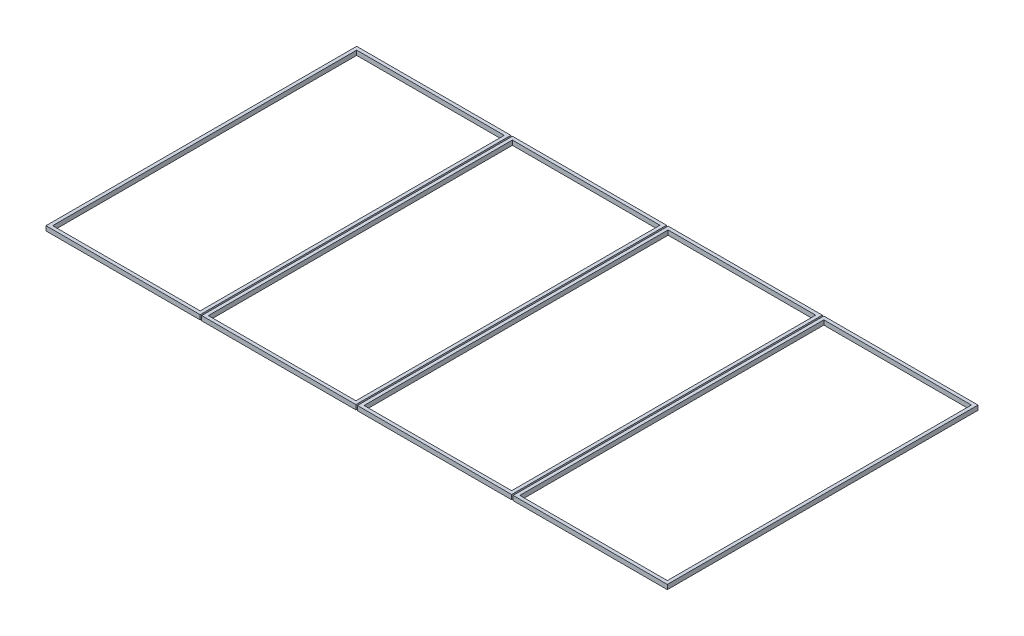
ISO-10303-21;
HEADER;
FILE_DESCRIPTION(('STEP AP214'),'2;1');
FILE_NAME('part.step','',(''),(''),'','','');
FILE_SCHEMA(('AUTOMOTIVE_DESIGN { 1 0 10303 214 1 1 1 1 }'));
ENDSEC;
DATA;
#1=APPLICATION_CONTEXT('core data for automotive mechanical design processes');
#2=APPLICATION_PROTOCOL_DEFINITION('international standard','automotive_design',2000,#1);
#3=PRODUCT_CONTEXT('',#1,'mechanical');
#4=PRODUCT('Part','Part','',(#3));
#5=PRODUCT_RELATED_PRODUCT_CATEGORY('part','',(#4));
#6=PRODUCT_DEFINITION_FORMATION('','',#4);
#7=PRODUCT_DEFINITION_CONTEXT('part definition',#1,'design');
#8=PRODUCT_DEFINITION('design','',#6,#7);
#9=PRODUCT_DEFINITION_SHAPE('','',#8);
#10=(LENGTH_UNIT() NAMED_UNIT(*) SI_UNIT(.MILLI.,.METRE.));
#11=(NAMED_UNIT(*) PLANE_ANGLE_UNIT() SI_UNIT($,.RADIAN.));
#12=(NAMED_UNIT(*) SI_UNIT($,.STERADIAN.) SOLID_ANGLE_UNIT());
#13=UNCERTAINTY_MEASURE_WITH_UNIT(LENGTH_MEASURE(1.E-05),#10,'distance_accuracy_value','');
#14=(GEOMETRIC_REPRESENTATION_CONTEXT(3) GLOBAL_UNCERTAINTY_ASSIGNED_CONTEXT((#13)) GLOBAL_UNIT_ASSIGNED_CONTEXT((#10,
#11,#12)) REPRESENTATION_CONTEXT('',''));
#15=CARTESIAN_POINT('',(0.,0.,0.));
#16=DIRECTION('',(0.,0.,1.));
#17=DIRECTION('',(1.,0.,0.));
#18=AXIS2_PLACEMENT_3D('',#15,#16,#17);
#19=CARTESIAN_POINT('',(0.,18.,0.));
#20=DIRECTION('',(0.,1.,0.));
#21=DIRECTION('',(0.,0.,1.));
#22=AXIS2_PLACEMENT_3D('',#19,#20,#21);
#23=PLANE('',#22);
#24=DIRECTION('',(1.,0.,0.));
#25=VECTOR('',#24,1.);
#26=CARTESIAN_POINT('',(1223.,18.,0.));
#27=LINE('',#26,#25);
#28=CARTESIAN_POINT('',(1223.,18.,0.));
#29=VERTEX_POINT('',#28);
#30=CARTESIAN_POINT('',(1828.5,18.,0.));
#31=VERTEX_POINT('',#30);
#32=EDGE_CURVE('E145',#29,#31,#27,.T.);
#33=ORIENTED_EDGE('',*,*,#32,.T.);
#34=DIRECTION('',(0.,0.,-1.));
#35=VECTOR('',#34,1.);
#36=CARTESIAN_POINT('',(1828.5,18.,0.));
#37=LINE('',#36,#35);
#38=CARTESIAN_POINT('',(1828.5,18.,-1220.));
#39=VERTEX_POINT('',#38);
#40=EDGE_CURVE('E147',#31,#39,#37,.T.);
#41=ORIENTED_EDGE('',*,*,#40,.T.);
#42=DIRECTION('',(-1.,0.,0.));
#43=VECTOR('',#42,1.);
#44=CARTESIAN_POINT('',(1223.,18.,-1220.));
#45=LINE('',#44,#43);
#46=CARTESIAN_POINT('',(1223.,18.,-1220.));
#47=VERTEX_POINT('',#46);
#48=EDGE_CURVE('E150',#39,#47,#45,.T.);
#49=ORIENTED_EDGE('',*,*,#48,.T.);
#50=DIRECTION('',(0.,0.,1.));
#51=VECTOR('',#50,1.);
#52=CARTESIAN_POINT('',(1223.,18.,0.));
#53=LINE('',#52,#51);
#54=EDGE_CURVE('E152',#47,#29,#53,.T.);
#55=ORIENTED_EDGE('',*,*,#54,.T.);
#56=EDGE_LOOP('',(#33,#41,#49,#55));
#57=FACE_BOUND('',#56,.T.);
#58=DIRECTION('',(1.,0.,0.));
#59=VECTOR('',#58,1.);
#60=CARTESIAN_POINT('',(1236.,18.,-13.));
#61=LINE('',#60,#59);
#62=CARTESIAN_POINT('',(1236.,18.,-13.));
#63=VERTEX_POINT('',#62);
#64=CARTESIAN_POINT('',(1815.5,18.,-13.));
#65=VERTEX_POINT('',#64);
#66=EDGE_CURVE('E117',#63,#65,#61,.T.);
#67=ORIENTED_EDGE('',*,*,#66,.F.);
#68=DIRECTION('',(0.,0.,1.));
#69=VECTOR('',#68,1.);
#70=CARTESIAN_POINT('',(1236.,18.,-13.));
#71=LINE('',#70,#69);
#72=CARTESIAN_POINT('',(1236.,18.,-1207.));
#73=VERTEX_POINT('',#72);
#74=EDGE_CURVE('E109',#73,#63,#71,.T.);
#75=ORIENTED_EDGE('',*,*,#74,.F.);
#76=DIRECTION('',(-1.,0.,0.));
#77=VECTOR('',#76,1.);
#78=CARTESIAN_POINT('',(1236.,18.,-1207.));
#79=LINE('',#78,#77);
#80=CARTESIAN_POINT('',(1815.5,18.,-1207.));
#81=VERTEX_POINT('',#80);
#82=EDGE_CURVE('E131',#81,#73,#79,.T.);
#83=ORIENTED_EDGE('',*,*,#82,.F.);
#84=DIRECTION('',(0.,0.,-1.));
#85=VECTOR('',#84,1.);
#86=CARTESIAN_POINT('',(1815.5,18.,-13.));
#87=LINE('',#86,#85);
#88=EDGE_CURVE('E129',#65,#81,#87,.T.);
#89=ORIENTED_EDGE('',*,*,#88,.F.);
#90=EDGE_LOOP('',(#67,#75,#83,#89));
#91=FACE_BOUND('',#90,.T.);
#92=ADVANCED_FACE('F44',(#57,#91),#23,.T.);
#93=CARTESIAN_POINT('',(0.,0.,0.));
#94=DIRECTION('',(0.,1.,0.));
#95=DIRECTION('',(0.,0.,1.));
#96=AXIS2_PLACEMENT_3D('',#93,#94,#95);
#97=PLANE('',#96);
#98=DIRECTION('',(1.,0.,0.));
#99=VECTOR('',#98,1.);
#100=CARTESIAN_POINT('',(1815.5,0.,0.));
#101=LINE('',#100,#99);
#102=CARTESIAN_POINT('',(1223.,0.,0.));
#103=VERTEX_POINT('',#102);
#104=CARTESIAN_POINT('',(1828.5,0.,0.));
#105=VERTEX_POINT('',#104);
#106=EDGE_CURVE('E125',#103,#105,#101,.T.);
#107=ORIENTED_EDGE('',*,*,#106,.F.);
#108=DIRECTION('',(0.,0.,1.));
#109=VECTOR('',#108,1.);
#110=CARTESIAN_POINT('',(1223.,0.,0.));
#111=LINE('',#110,#109);
#112=CARTESIAN_POINT('',(1223.,0.,-1220.));
#113=VERTEX_POINT('',#112);
#114=EDGE_CURVE('E148',#113,#103,#111,.T.);
#115=ORIENTED_EDGE('',*,*,#114,.F.);
#116=DIRECTION('',(-1.,0.,0.));
#117=VECTOR('',#116,1.);
#118=CARTESIAN_POINT('',(1223.,0.,-1220.));
#119=LINE('',#118,#117);
#120=CARTESIAN_POINT('',(1828.5,0.,-1220.));
#121=VERTEX_POINT('',#120);
#122=EDGE_CURVE('E158',#121,#113,#119,.T.);
#123=ORIENTED_EDGE('',*,*,#122,.F.);
#124=DIRECTION('',(0.,0.,-1.));
#125=VECTOR('',#124,1.);
#126=CARTESIAN_POINT('',(1828.5,0.,0.));
#127=LINE('',#126,#125);
#128=EDGE_CURVE('E156',#105,#121,#127,.T.);
#129=ORIENTED_EDGE('',*,*,#128,.F.);
#130=EDGE_LOOP('',(#107,#115,#123,#129));
#131=FACE_BOUND('',#130,.T.);
#132=DIRECTION('',(0.,0.,1.));
#133=VECTOR('',#132,1.);
#134=CARTESIAN_POINT('',(1236.,0.,-13.));
#135=LINE('',#134,#133);
#136=CARTESIAN_POINT('',(1236.,0.,-1207.));
#137=VERTEX_POINT('',#136);
#138=CARTESIAN_POINT('',(1236.,0.,-13.));
#139=VERTEX_POINT('',#138);
#140=EDGE_CURVE('E67',#137,#139,#135,.T.);
#141=ORIENTED_EDGE('',*,*,#140,.T.);
#142=DIRECTION('',(1.,0.,0.));
#143=VECTOR('',#142,1.);
#144=CARTESIAN_POINT('',(1236.,0.,-13.));
#145=LINE('',#144,#143);
#146=CARTESIAN_POINT('',(1815.5,0.,-13.));
#147=VERTEX_POINT('',#146);
#148=EDGE_CURVE('E124',#139,#147,#145,.T.);
#149=ORIENTED_EDGE('',*,*,#148,.T.);
#150=DIRECTION('',(0.,0.,-1.));
#151=VECTOR('',#150,1.);
#152=CARTESIAN_POINT('',(1815.5,0.,-13.));
#153=LINE('',#152,#151);
#154=CARTESIAN_POINT('',(1815.5,0.,-1207.));
#155=VERTEX_POINT('',#154);
#156=EDGE_CURVE('E137',#147,#155,#153,.T.);
#157=ORIENTED_EDGE('',*,*,#156,.T.);
#158=DIRECTION('',(-1.,0.,0.));
#159=VECTOR('',#158,1.);
#160=CARTESIAN_POINT('',(1236.,0.,-1207.));
#161=LINE('',#160,#159);
#162=EDGE_CURVE('E118',#155,#137,#161,.T.);
#163=ORIENTED_EDGE('',*,*,#162,.T.);
#164=EDGE_LOOP('',(#141,#149,#157,#163));
#165=FACE_BOUND('',#164,.T.);
#166=ADVANCED_FACE('F178',(#131,#165),#97,.F.);
#167=CARTESIAN_POINT('',(1815.5,18.,0.));
#168=DIRECTION('',(0.,0.,-1.));
#169=DIRECTION('',(-1.,0.,0.));
#170=AXIS2_PLACEMENT_3D('',#167,#168,#169);
#171=PLANE('',#170);
#172=ORIENTED_EDGE('',*,*,#106,.T.);
#173=DIRECTION('',(0.,-1.,0.));
#174=VECTOR('',#173,1.);
#175=CARTESIAN_POINT('',(1828.5,18.,0.));
#176=LINE('',#175,#174);
#177=EDGE_CURVE('E12',#31,#105,#176,.T.);
#178=ORIENTED_EDGE('',*,*,#177,.F.);
#179=ORIENTED_EDGE('',*,*,#32,.F.);
#180=DIRECTION('',(0.,-1.,0.));
#181=VECTOR('',#180,1.);
#182=CARTESIAN_POINT('',(1223.,18.,0.));
#183=LINE('',#182,#181);
#184=EDGE_CURVE('E154',#29,#103,#183,.T.);
#185=ORIENTED_EDGE('',*,*,#184,.T.);
#186=EDGE_LOOP('',(#172,#178,#179,#185));
#187=FACE_BOUND('',#186,.T.);
#188=ADVANCED_FACE('F46',(#187),#171,.F.);
#189=CARTESIAN_POINT('',(1828.5,18.,0.));
#190=DIRECTION('',(-1.,0.,0.));
#191=DIRECTION('',(0.,0.,1.));
#192=AXIS2_PLACEMENT_3D('',#189,#190,#191);
#193=PLANE('',#192);
#194=ORIENTED_EDGE('',*,*,#128,.T.);
#195=DIRECTION('',(0.,-1.,0.));
#196=VECTOR('',#195,1.);
#197=CARTESIAN_POINT('',(1828.5,18.,-1220.));
#198=LINE('',#197,#196);
#199=EDGE_CURVE('E52',#39,#121,#198,.T.);
#200=ORIENTED_EDGE('',*,*,#199,.F.);
#201=ORIENTED_EDGE('',*,*,#40,.F.);
#202=ORIENTED_EDGE('',*,*,#177,.T.);
#203=EDGE_LOOP('',(#194,#200,#201,#202));
#204=FACE_BOUND('',#203,.T.);
#205=ADVANCED_FACE('F188',(#204),#193,.F.);
#206=CARTESIAN_POINT('',(1223.,18.,-1220.));
#207=DIRECTION('',(0.,0.,1.));
#208=DIRECTION('',(1.,0.,0.));
#209=AXIS2_PLACEMENT_3D('',#206,#207,#208);
#210=PLANE('',#209);
#211=ORIENTED_EDGE('',*,*,#122,.T.);
#212=DIRECTION('',(0.,-1.,0.));
#213=VECTOR('',#212,1.);
#214=CARTESIAN_POINT('',(1223.,18.,-1220.));
#215=LINE('',#214,#213);
#216=EDGE_CURVE('E164',#47,#113,#215,.T.);
#217=ORIENTED_EDGE('',*,*,#216,.F.);
#218=ORIENTED_EDGE('',*,*,#48,.F.);
#219=ORIENTED_EDGE('',*,*,#199,.T.);
#220=EDGE_LOOP('',(#211,#217,#218,#219));
#221=FACE_BOUND('',#220,.T.);
#222=ADVANCED_FACE('F171',(#221),#210,.F.);
#223=CARTESIAN_POINT('',(1223.,18.,0.));
#224=DIRECTION('',(1.,0.,0.));
#225=DIRECTION('',(0.,0.,-1.));
#226=AXIS2_PLACEMENT_3D('',#223,#224,#225);
#227=PLANE('',#226);
#228=ORIENTED_EDGE('',*,*,#114,.T.);
#229=ORIENTED_EDGE('',*,*,#184,.F.);
#230=ORIENTED_EDGE('',*,*,#54,.F.);
#231=ORIENTED_EDGE('',*,*,#216,.T.);
#232=EDGE_LOOP('',(#228,#229,#230,#231));
#233=FACE_BOUND('',#232,.T.);
#234=ADVANCED_FACE('F182',(#233),#227,.F.);
#235=CARTESIAN_POINT('',(1236.,18.,-13.));
#236=DIRECTION('',(1.,0.,0.));
#237=DIRECTION('',(0.,0.,-1.));
#238=AXIS2_PLACEMENT_3D('',#235,#236,#237);
#239=PLANE('',#238);
#240=ORIENTED_EDGE('',*,*,#140,.F.);
#241=DIRECTION('',(0.,-1.,0.));
#242=VECTOR('',#241,1.);
#243=CARTESIAN_POINT('',(1236.,18.,-1207.));
#244=LINE('',#243,#242);
#245=EDGE_CURVE('E113',#73,#137,#244,.T.);
#246=ORIENTED_EDGE('',*,*,#245,.F.);
#247=ORIENTED_EDGE('',*,*,#74,.T.);
#248=DIRECTION('',(0.,-1.,0.));
#249=VECTOR('',#248,1.);
#250=CARTESIAN_POINT('',(1236.,18.,-13.));
#251=LINE('',#250,#249);
#252=EDGE_CURVE('E112',#63,#139,#251,.T.);
#253=ORIENTED_EDGE('',*,*,#252,.T.);
#254=EDGE_LOOP('',(#240,#246,#247,#253));
#255=FACE_BOUND('',#254,.T.);
#256=ADVANCED_FACE('F111',(#255),#239,.T.);
#257=CARTESIAN_POINT('',(1236.,18.,-13.));
#258=DIRECTION('',(0.,0.,-1.));
#259=DIRECTION('',(-1.,0.,0.));
#260=AXIS2_PLACEMENT_3D('',#257,#258,#259);
#261=PLANE('',#260);
#262=ORIENTED_EDGE('',*,*,#148,.F.);
#263=ORIENTED_EDGE('',*,*,#252,.F.);
#264=ORIENTED_EDGE('',*,*,#66,.T.);
#265=DIRECTION('',(0.,-1.,0.));
#266=VECTOR('',#265,1.);
#267=CARTESIAN_POINT('',(1815.5,18.,-13.));
#268=LINE('',#267,#266);
#269=EDGE_CURVE('E126',#65,#147,#268,.T.);
#270=ORIENTED_EDGE('',*,*,#269,.T.);
#271=EDGE_LOOP('',(#262,#263,#264,#270));
#272=FACE_BOUND('',#271,.T.);
#273=ADVANCED_FACE('F121',(#272),#261,.T.);
#274=CARTESIAN_POINT('',(1815.5,18.,-13.));
#275=DIRECTION('',(-1.,0.,0.));
#276=DIRECTION('',(0.,0.,1.));
#277=AXIS2_PLACEMENT_3D('',#274,#275,#276);
#278=PLANE('',#277);
#279=ORIENTED_EDGE('',*,*,#156,.F.);
#280=ORIENTED_EDGE('',*,*,#269,.F.);
#281=ORIENTED_EDGE('',*,*,#88,.T.);
#282=DIRECTION('',(0.,-1.,0.));
#283=VECTOR('',#282,1.);
#284=CARTESIAN_POINT('',(1815.5,18.,-1207.));
#285=LINE('',#284,#283);
#286=EDGE_CURVE('E59',#81,#155,#285,.T.);
#287=ORIENTED_EDGE('',*,*,#286,.T.);
#288=EDGE_LOOP('',(#279,#280,#281,#287));
#289=FACE_BOUND('',#288,.T.);
#290=ADVANCED_FACE('F211',(#289),#278,.T.);
#291=CARTESIAN_POINT('',(1236.,18.,-1207.));
#292=DIRECTION('',(0.,0.,1.));
#293=DIRECTION('',(1.,0.,0.));
#294=AXIS2_PLACEMENT_3D('',#291,#292,#293);
#295=PLANE('',#294);
#296=ORIENTED_EDGE('',*,*,#162,.F.);
#297=ORIENTED_EDGE('',*,*,#286,.F.);
#298=ORIENTED_EDGE('',*,*,#82,.T.);
#299=ORIENTED_EDGE('',*,*,#245,.T.);
#300=EDGE_LOOP('',(#296,#297,#298,#299));
#301=FACE_BOUND('',#300,.T.);
#302=ADVANCED_FACE('F215',(#301),#295,.T.);
#303=CLOSED_SHELL('',(#92,#166,#188,#205,#222,#234,#256,#273,#290,#302));
#304=MANIFOLD_SOLID_BREP('B2',#303);
#305=CARTESIAN_POINT('',(0.,18.,0.));
#306=DIRECTION('',(0.,1.,0.));
#307=DIRECTION('',(0.,0.,1.));
#308=AXIS2_PLACEMENT_3D('',#305,#306,#307);
#309=PLANE('',#308);
#310=DIRECTION('',(1.,0.,0.));
#311=VECTOR('',#310,1.);
#312=CARTESIAN_POINT('',(611.5,18.,0.));
#313=LINE('',#312,#311);
#314=CARTESIAN_POINT('',(611.5,18.,0.));
#315=VERTEX_POINT('',#314);
#316=CARTESIAN_POINT('',(1217.,18.,0.));
#317=VERTEX_POINT('',#316);
#318=EDGE_CURVE('E391',#315,#317,#313,.T.);
#319=ORIENTED_EDGE('',*,*,#318,.T.);
#320=DIRECTION('',(0.,0.,-1.));
#321=VECTOR('',#320,1.);
#322=CARTESIAN_POINT('',(1217.,18.,0.));
#323=LINE('',#322,#321);
#324=CARTESIAN_POINT('',(1217.,18.,-1220.));
#325=VERTEX_POINT('',#324);
#326=EDGE_CURVE('E393',#317,#325,#323,.T.);
#327=ORIENTED_EDGE('',*,*,#326,.T.);
#328=DIRECTION('',(-1.,0.,0.));
#329=VECTOR('',#328,1.);
#330=CARTESIAN_POINT('',(611.5,18.,-1220.));
#331=LINE('',#330,#329);
#332=CARTESIAN_POINT('',(611.5,18.,-1220.));
#333=VERTEX_POINT('',#332);
#334=EDGE_CURVE('E396',#325,#333,#331,.T.);
#335=ORIENTED_EDGE('',*,*,#334,.T.);
#336=DIRECTION('',(0.,0.,1.));
#337=VECTOR('',#336,1.);
#338=CARTESIAN_POINT('',(611.5,18.,0.));
#339=LINE('',#338,#337);
#340=EDGE_CURVE('E398',#333,#315,#339,.T.);
#341=ORIENTED_EDGE('',*,*,#340,.T.);
#342=EDGE_LOOP('',(#319,#327,#335,#341));
#343=FACE_BOUND('',#342,.T.);
#344=DIRECTION('',(1.,0.,0.));
#345=VECTOR('',#344,1.);
#346=CARTESIAN_POINT('',(624.5,18.,-13.));
#347=LINE('',#346,#345);
#348=CARTESIAN_POINT('',(624.5,18.,-13.));
#349=VERTEX_POINT('',#348);
#350=CARTESIAN_POINT('',(1204.,18.,-13.));
#351=VERTEX_POINT('',#350);
#352=EDGE_CURVE('E363',#349,#351,#347,.T.);
#353=ORIENTED_EDGE('',*,*,#352,.F.);
#354=DIRECTION('',(0.,0.,1.));
#355=VECTOR('',#354,1.);
#356=CARTESIAN_POINT('',(624.5,18.,-1207.));
#357=LINE('',#356,#355);
#358=CARTESIAN_POINT('',(624.5,18.,-1207.));
#359=VERTEX_POINT('',#358);
#360=EDGE_CURVE('E355',#359,#349,#357,.T.);
#361=ORIENTED_EDGE('',*,*,#360,.F.);
#362=DIRECTION('',(-1.,0.,0.));
#363=VECTOR('',#362,1.);
#364=CARTESIAN_POINT('',(624.5,18.,-1207.));
#365=LINE('',#364,#363);
#366=CARTESIAN_POINT('',(1204.,18.,-1207.));
#367=VERTEX_POINT('',#366);
#368=EDGE_CURVE('E377',#367,#359,#365,.T.);
#369=ORIENTED_EDGE('',*,*,#368,.F.);
#370=DIRECTION('',(0.,0.,-1.));
#371=VECTOR('',#370,1.);
#372=CARTESIAN_POINT('',(1204.,18.,-1207.));
#373=LINE('',#372,#371);
#374=EDGE_CURVE('E375',#351,#367,#373,.T.);
#375=ORIENTED_EDGE('',*,*,#374,.F.);
#376=EDGE_LOOP('',(#353,#361,#369,#375));
#377=FACE_BOUND('',#376,.T.);
#378=ADVANCED_FACE('F290',(#343,#377),#309,.T.);
#379=CARTESIAN_POINT('',(0.,0.,0.));
#380=DIRECTION('',(0.,1.,0.));
#381=DIRECTION('',(0.,0.,1.));
#382=AXIS2_PLACEMENT_3D('',#379,#380,#381);
#383=PLANE('',#382);
#384=DIRECTION('',(1.,0.,0.));
#385=VECTOR('',#384,1.);
#386=CARTESIAN_POINT('',(1204.,0.,0.));
#387=LINE('',#386,#385);
#388=CARTESIAN_POINT('',(611.5,0.,0.));
#389=VERTEX_POINT('',#388);
#390=CARTESIAN_POINT('',(1217.,0.,0.));
#391=VERTEX_POINT('',#390);
#392=EDGE_CURVE('E371',#389,#391,#387,.T.);
#393=ORIENTED_EDGE('',*,*,#392,.F.);
#394=DIRECTION('',(0.,0.,1.));
#395=VECTOR('',#394,1.);
#396=CARTESIAN_POINT('',(611.5,0.,0.));
#397=LINE('',#396,#395);
#398=CARTESIAN_POINT('',(611.5,0.,-1220.));
#399=VERTEX_POINT('',#398);
#400=EDGE_CURVE('E394',#399,#389,#397,.T.);
#401=ORIENTED_EDGE('',*,*,#400,.F.);
#402=DIRECTION('',(-1.,0.,0.));
#403=VECTOR('',#402,1.);
#404=CARTESIAN_POINT('',(611.5,0.,-1220.));
#405=LINE('',#404,#403);
#406=CARTESIAN_POINT('',(1217.,0.,-1220.));
#407=VERTEX_POINT('',#406);
#408=EDGE_CURVE('E404',#407,#399,#405,.T.);
#409=ORIENTED_EDGE('',*,*,#408,.F.);
#410=DIRECTION('',(0.,0.,-1.));
#411=VECTOR('',#410,1.);
#412=CARTESIAN_POINT('',(1217.,0.,0.));
#413=LINE('',#412,#411);
#414=EDGE_CURVE('E402',#391,#407,#413,.T.);
#415=ORIENTED_EDGE('',*,*,#414,.F.);
#416=EDGE_LOOP('',(#393,#401,#409,#415));
#417=FACE_BOUND('',#416,.T.);
#418=DIRECTION('',(0.,0.,1.));
#419=VECTOR('',#418,1.);
#420=CARTESIAN_POINT('',(624.5,0.,-1207.));
#421=LINE('',#420,#419);
#422=CARTESIAN_POINT('',(624.5,0.,-1207.));
#423=VERTEX_POINT('',#422);
#424=CARTESIAN_POINT('',(624.5,0.,-13.));
#425=VERTEX_POINT('',#424);
#426=EDGE_CURVE('E313',#423,#425,#421,.T.);
#427=ORIENTED_EDGE('',*,*,#426,.T.);
#428=DIRECTION('',(1.,0.,0.));
#429=VECTOR('',#428,1.);
#430=CARTESIAN_POINT('',(624.5,0.,-13.));
#431=LINE('',#430,#429);
#432=CARTESIAN_POINT('',(1204.,0.,-13.));
#433=VERTEX_POINT('',#432);
#434=EDGE_CURVE('E370',#425,#433,#431,.T.);
#435=ORIENTED_EDGE('',*,*,#434,.T.);
#436=DIRECTION('',(0.,0.,-1.));
#437=VECTOR('',#436,1.);
#438=CARTESIAN_POINT('',(1204.,0.,-1207.));
#439=LINE('',#438,#437);
#440=CARTESIAN_POINT('',(1204.,0.,-1207.));
#441=VERTEX_POINT('',#440);
#442=EDGE_CURVE('E383',#433,#441,#439,.T.);
#443=ORIENTED_EDGE('',*,*,#442,.T.);
#444=DIRECTION('',(-1.,0.,0.));
#445=VECTOR('',#444,1.);
#446=CARTESIAN_POINT('',(624.5,0.,-1207.));
#447=LINE('',#446,#445);
#448=EDGE_CURVE('E364',#441,#423,#447,.T.);
#449=ORIENTED_EDGE('',*,*,#448,.T.);
#450=EDGE_LOOP('',(#427,#435,#443,#449));
#451=FACE_BOUND('',#450,.T.);
#452=ADVANCED_FACE('F424',(#417,#451),#383,.F.);
#453=CARTESIAN_POINT('',(1204.,18.,0.));
#454=DIRECTION('',(0.,0.,-1.));
#455=DIRECTION('',(-1.,0.,0.));
#456=AXIS2_PLACEMENT_3D('',#453,#454,#455);
#457=PLANE('',#456);
#458=ORIENTED_EDGE('',*,*,#392,.T.);
#459=DIRECTION('',(0.,-1.,0.));
#460=VECTOR('',#459,1.);
#461=CARTESIAN_POINT('',(1217.,18.,0.));
#462=LINE('',#461,#460);
#463=EDGE_CURVE('E42',#317,#391,#462,.T.);
#464=ORIENTED_EDGE('',*,*,#463,.F.);
#465=ORIENTED_EDGE('',*,*,#318,.F.);
#466=DIRECTION('',(0.,-1.,0.));
#467=VECTOR('',#466,1.);
#468=CARTESIAN_POINT('',(611.5,18.,0.));
#469=LINE('',#468,#467);
#470=EDGE_CURVE('E400',#315,#389,#469,.T.);
#471=ORIENTED_EDGE('',*,*,#470,.T.);
#472=EDGE_LOOP('',(#458,#464,#465,#471));
#473=FACE_BOUND('',#472,.T.);
#474=ADVANCED_FACE('F292',(#473),#457,.F.);
#475=CARTESIAN_POINT('',(1217.,18.,0.));
#476=DIRECTION('',(-1.,0.,0.));
#477=DIRECTION('',(0.,0.,1.));
#478=AXIS2_PLACEMENT_3D('',#475,#476,#477);
#479=PLANE('',#478);
#480=ORIENTED_EDGE('',*,*,#414,.T.);
#481=DIRECTION('',(0.,-1.,0.));
#482=VECTOR('',#481,1.);
#483=CARTESIAN_POINT('',(1217.,18.,-1220.));
#484=LINE('',#483,#482);
#485=EDGE_CURVE('E298',#325,#407,#484,.T.);
#486=ORIENTED_EDGE('',*,*,#485,.F.);
#487=ORIENTED_EDGE('',*,*,#326,.F.);
#488=ORIENTED_EDGE('',*,*,#463,.T.);
#489=EDGE_LOOP('',(#480,#486,#487,#488));
#490=FACE_BOUND('',#489,.T.);
#491=ADVANCED_FACE('F434',(#490),#479,.F.);
#492=CARTESIAN_POINT('',(611.5,18.,-1220.));
#493=DIRECTION('',(0.,0.,1.));
#494=DIRECTION('',(1.,0.,0.));
#495=AXIS2_PLACEMENT_3D('',#492,#493,#494);
#496=PLANE('',#495);
#497=ORIENTED_EDGE('',*,*,#408,.T.);
#498=DIRECTION('',(0.,-1.,0.));
#499=VECTOR('',#498,1.);
#500=CARTESIAN_POINT('',(611.5,18.,-1220.));
#501=LINE('',#500,#499);
#502=EDGE_CURVE('E410',#333,#399,#501,.T.);
#503=ORIENTED_EDGE('',*,*,#502,.F.);
#504=ORIENTED_EDGE('',*,*,#334,.F.);
#505=ORIENTED_EDGE('',*,*,#485,.T.);
#506=EDGE_LOOP('',(#497,#503,#504,#505));
#507=FACE_BOUND('',#506,.T.);
#508=ADVANCED_FACE('F417',(#507),#496,.F.);
#509=CARTESIAN_POINT('',(611.5,18.,0.));
#510=DIRECTION('',(1.,0.,0.));
#511=DIRECTION('',(0.,0.,-1.));
#512=AXIS2_PLACEMENT_3D('',#509,#510,#511);
#513=PLANE('',#512);
#514=ORIENTED_EDGE('',*,*,#400,.T.);
#515=ORIENTED_EDGE('',*,*,#470,.F.);
#516=ORIENTED_EDGE('',*,*,#340,.F.);
#517=ORIENTED_EDGE('',*,*,#502,.T.);
#518=EDGE_LOOP('',(#514,#515,#516,#517));
#519=FACE_BOUND('',#518,.T.);
#520=ADVANCED_FACE('F428',(#519),#513,.F.);
#521=CARTESIAN_POINT('',(624.5,18.,-1207.));
#522=DIRECTION('',(1.,0.,0.));
#523=DIRECTION('',(0.,0.,-1.));
#524=AXIS2_PLACEMENT_3D('',#521,#522,#523);
#525=PLANE('',#524);
#526=ORIENTED_EDGE('',*,*,#426,.F.);
#527=DIRECTION('',(0.,-1.,0.));
#528=VECTOR('',#527,1.);
#529=CARTESIAN_POINT('',(624.5,18.,-1207.));
#530=LINE('',#529,#528);
#531=EDGE_CURVE('E359',#359,#423,#530,.T.);
#532=ORIENTED_EDGE('',*,*,#531,.F.);
#533=ORIENTED_EDGE('',*,*,#360,.T.);
#534=DIRECTION('',(0.,-1.,0.));
#535=VECTOR('',#534,1.);
#536=CARTESIAN_POINT('',(624.5,18.,-13.));
#537=LINE('',#536,#535);
#538=EDGE_CURVE('E358',#349,#425,#537,.T.);
#539=ORIENTED_EDGE('',*,*,#538,.T.);
#540=EDGE_LOOP('',(#526,#532,#533,#539));
#541=FACE_BOUND('',#540,.T.);
#542=ADVANCED_FACE('F357',(#541),#525,.T.);
#543=CARTESIAN_POINT('',(624.5,18.,-13.));
#544=DIRECTION('',(0.,0.,-1.));
#545=DIRECTION('',(-1.,0.,0.));
#546=AXIS2_PLACEMENT_3D('',#543,#544,#545);
#547=PLANE('',#546);
#548=ORIENTED_EDGE('',*,*,#434,.F.);
#549=ORIENTED_EDGE('',*,*,#538,.F.);
#550=ORIENTED_EDGE('',*,*,#352,.T.);
#551=DIRECTION('',(0.,-1.,0.));
#552=VECTOR('',#551,1.);
#553=CARTESIAN_POINT('',(1204.,18.,-13.));
#554=LINE('',#553,#552);
#555=EDGE_CURVE('E372',#351,#433,#554,.T.);
#556=ORIENTED_EDGE('',*,*,#555,.T.);
#557=EDGE_LOOP('',(#548,#549,#550,#556));
#558=FACE_BOUND('',#557,.T.);
#559=ADVANCED_FACE('F367',(#558),#547,.T.);
#560=CARTESIAN_POINT('',(1204.,18.,-1207.));
#561=DIRECTION('',(-1.,0.,0.));
#562=DIRECTION('',(0.,0.,1.));
#563=AXIS2_PLACEMENT_3D('',#560,#561,#562);
#564=PLANE('',#563);
#565=ORIENTED_EDGE('',*,*,#442,.F.);
#566=ORIENTED_EDGE('',*,*,#555,.F.);
#567=ORIENTED_EDGE('',*,*,#374,.T.);
#568=DIRECTION('',(0.,-1.,0.));
#569=VECTOR('',#568,1.);
#570=CARTESIAN_POINT('',(1204.,18.,-1207.));
#571=LINE('',#570,#569);
#572=EDGE_CURVE('E305',#367,#441,#571,.T.);
#573=ORIENTED_EDGE('',*,*,#572,.T.);
#574=EDGE_LOOP('',(#565,#566,#567,#573));
#575=FACE_BOUND('',#574,.T.);
#576=ADVANCED_FACE('F457',(#575),#564,.T.);
#577=CARTESIAN_POINT('',(624.5,18.,-1207.));
#578=DIRECTION('',(0.,0.,1.));
#579=DIRECTION('',(1.,0.,0.));
#580=AXIS2_PLACEMENT_3D('',#577,#578,#579);
#581=PLANE('',#580);
#582=ORIENTED_EDGE('',*,*,#448,.F.);
#583=ORIENTED_EDGE('',*,*,#572,.F.);
#584=ORIENTED_EDGE('',*,*,#368,.T.);
#585=ORIENTED_EDGE('',*,*,#531,.T.);
#586=EDGE_LOOP('',(#582,#583,#584,#585));
#587=FACE_BOUND('',#586,.T.);
#588=ADVANCED_FACE('F461',(#587),#581,.T.);
#589=CLOSED_SHELL('',(#378,#452,#474,#491,#508,#520,#542,#559,#576,#588));
#590=MANIFOLD_SOLID_BREP('B6',#589);
#591=CARTESIAN_POINT('',(0.,18.,0.));
#592=DIRECTION('',(0.,1.,0.));
#593=DIRECTION('',(0.,0.,1.));
#594=AXIS2_PLACEMENT_3D('',#591,#592,#593);
#595=PLANE('',#594);
#596=DIRECTION('',(-1.,0.,0.));
#597=VECTOR('',#596,1.);
#598=CARTESIAN_POINT('',(1834.5,18.,-1220.));
#599=LINE('',#598,#597);
#600=CARTESIAN_POINT('',(2440.,18.,-1220.));
#601=VERTEX_POINT('',#600);
#602=CARTESIAN_POINT('',(1834.5,18.,-1220.));
#603=VERTEX_POINT('',#602);
#604=EDGE_CURVE('E636',#601,#603,#599,.T.);
#605=ORIENTED_EDGE('',*,*,#604,.T.);
#606=DIRECTION('',(0.,0.,1.));
#607=VECTOR('',#606,1.);
#608=CARTESIAN_POINT('',(1834.5,18.,0.));
#609=LINE('',#608,#607);
#610=CARTESIAN_POINT('',(1834.5,18.,0.));
#611=VERTEX_POINT('',#610);
#612=EDGE_CURVE('E639',#603,#611,#609,.T.);
#613=ORIENTED_EDGE('',*,*,#612,.T.);
#614=DIRECTION('',(1.,0.,0.));
#615=VECTOR('',#614,1.);
#616=CARTESIAN_POINT('',(1834.5,18.,0.));
#617=LINE('',#616,#615);
#618=CARTESIAN_POINT('',(2440.,18.,0.));
#619=VERTEX_POINT('',#618);
#620=EDGE_CURVE('E642',#611,#619,#617,.T.);
#621=ORIENTED_EDGE('',*,*,#620,.T.);
#622=DIRECTION('',(0.,0.,-1.));
#623=VECTOR('',#622,1.);
#624=CARTESIAN_POINT('',(2440.,18.,0.));
#625=LINE('',#624,#623);
#626=EDGE_CURVE('E644',#619,#601,#625,.T.);
#627=ORIENTED_EDGE('',*,*,#626,.T.);
#628=EDGE_LOOP('',(#605,#613,#621,#627));
#629=FACE_BOUND('',#628,.T.);
#630=DIRECTION('',(1.,0.,0.));
#631=VECTOR('',#630,1.);
#632=CARTESIAN_POINT('',(1847.5,18.,-13.));
#633=LINE('',#632,#631);
#634=CARTESIAN_POINT('',(1847.5,18.,-13.));
#635=VERTEX_POINT('',#634);
#636=CARTESIAN_POINT('',(2427.,18.,-13.));
#637=VERTEX_POINT('',#636);
#638=EDGE_CURVE('E608',#635,#637,#633,.T.);
#639=ORIENTED_EDGE('',*,*,#638,.F.);
#640=DIRECTION('',(0.,0.,1.));
#641=VECTOR('',#640,1.);
#642=CARTESIAN_POINT('',(1847.5,18.,-1207.));
#643=LINE('',#642,#641);
#644=CARTESIAN_POINT('',(1847.5,18.,-1207.));
#645=VERTEX_POINT('',#644);
#646=EDGE_CURVE('E600',#645,#635,#643,.T.);
#647=ORIENTED_EDGE('',*,*,#646,.F.);
#648=DIRECTION('',(-1.,0.,0.));
#649=VECTOR('',#648,1.);
#650=CARTESIAN_POINT('',(1847.5,18.,-1207.));
#651=LINE('',#650,#649);
#652=CARTESIAN_POINT('',(2427.,18.,-1207.));
#653=VERTEX_POINT('',#652);
#654=EDGE_CURVE('E622',#653,#645,#651,.T.);
#655=ORIENTED_EDGE('',*,*,#654,.F.);
#656=DIRECTION('',(0.,0.,-1.));
#657=VECTOR('',#656,1.);
#658=CARTESIAN_POINT('',(2427.,18.,-1207.));
#659=LINE('',#658,#657);
#660=EDGE_CURVE('E620',#637,#653,#659,.T.);
#661=ORIENTED_EDGE('',*,*,#660,.F.);
#662=EDGE_LOOP('',(#639,#647,#655,#661));
#663=FACE_BOUND('',#662,.T.);
#664=ADVANCED_FACE('F535',(#629,#663),#595,.T.);
#665=CARTESIAN_POINT('',(0.,0.,0.));
#666=DIRECTION('',(0.,1.,0.));
#667=DIRECTION('',(0.,0.,1.));
#668=AXIS2_PLACEMENT_3D('',#665,#666,#667);
#669=PLANE('',#668);
#670=DIRECTION('',(-1.,0.,0.));
#671=VECTOR('',#670,1.);
#672=CARTESIAN_POINT('',(1834.5,0.,-1220.));
#673=LINE('',#672,#671);
#674=CARTESIAN_POINT('',(2440.,0.,-1220.));
#675=VERTEX_POINT('',#674);
#676=CARTESIAN_POINT('',(1834.5,0.,-1220.));
#677=VERTEX_POINT('',#676);
#678=EDGE_CURVE('E616',#675,#677,#673,.T.);
#679=ORIENTED_EDGE('',*,*,#678,.F.);
#680=DIRECTION('',(0.,0.,-1.));
#681=VECTOR('',#680,1.);
#682=CARTESIAN_POINT('',(2440.,0.,0.));
#683=LINE('',#682,#681);
#684=CARTESIAN_POINT('',(2440.,0.,0.));
#685=VERTEX_POINT('',#684);
#686=EDGE_CURVE('E640',#685,#675,#683,.T.);
#687=ORIENTED_EDGE('',*,*,#686,.F.);
#688=DIRECTION('',(1.,0.,0.));
#689=VECTOR('',#688,1.);
#690=CARTESIAN_POINT('',(2427.,0.,0.));
#691=LINE('',#690,#689);
#692=CARTESIAN_POINT('',(1834.5,0.,0.));
#693=VERTEX_POINT('',#692);
#694=EDGE_CURVE('E652',#693,#685,#691,.T.);
#695=ORIENTED_EDGE('',*,*,#694,.F.);
#696=DIRECTION('',(0.,0.,1.));
#697=VECTOR('',#696,1.);
#698=CARTESIAN_POINT('',(1834.5,0.,0.));
#699=LINE('',#698,#697);
#700=EDGE_CURVE('E649',#677,#693,#699,.T.);
#701=ORIENTED_EDGE('',*,*,#700,.F.);
#702=EDGE_LOOP('',(#679,#687,#695,#701));
#703=FACE_BOUND('',#702,.T.);
#704=DIRECTION('',(0.,0.,1.));
#705=VECTOR('',#704,1.);
#706=CARTESIAN_POINT('',(1847.5,0.,-1207.));
#707=LINE('',#706,#705);
#708=CARTESIAN_POINT('',(1847.5,0.,-1207.));
#709=VERTEX_POINT('',#708);
#710=CARTESIAN_POINT('',(1847.5,0.,-13.));
#711=VERTEX_POINT('',#710);
#712=EDGE_CURVE('E558',#709,#711,#707,.T.);
#713=ORIENTED_EDGE('',*,*,#712,.T.);
#714=DIRECTION('',(1.,0.,0.));
#715=VECTOR('',#714,1.);
#716=CARTESIAN_POINT('',(1847.5,0.,-13.));
#717=LINE('',#716,#715);
#718=CARTESIAN_POINT('',(2427.,0.,-13.));
#719=VERTEX_POINT('',#718);
#720=EDGE_CURVE('E615',#711,#719,#717,.T.);
#721=ORIENTED_EDGE('',*,*,#720,.T.);
#722=DIRECTION('',(0.,0.,-1.));
#723=VECTOR('',#722,1.);
#724=CARTESIAN_POINT('',(2427.,0.,-1207.));
#725=LINE('',#724,#723);
#726=CARTESIAN_POINT('',(2427.,0.,-1207.));
#727=VERTEX_POINT('',#726);
#728=EDGE_CURVE('E628',#719,#727,#725,.T.);
#729=ORIENTED_EDGE('',*,*,#728,.T.);
#730=DIRECTION('',(-1.,0.,0.));
#731=VECTOR('',#730,1.);
#732=CARTESIAN_POINT('',(1847.5,0.,-1207.));
#733=LINE('',#732,#731);
#734=EDGE_CURVE('E609',#727,#709,#733,.T.);
#735=ORIENTED_EDGE('',*,*,#734,.T.);
#736=EDGE_LOOP('',(#713,#721,#729,#735));
#737=FACE_BOUND('',#736,.T.);
#738=ADVANCED_FACE('F670',(#703,#737),#669,.F.);
#739=CARTESIAN_POINT('',(1834.5,18.,-1220.));
#740=DIRECTION('',(0.,0.,1.));
#741=DIRECTION('',(1.,0.,0.));
#742=AXIS2_PLACEMENT_3D('',#739,#740,#741);
#743=PLANE('',#742);
#744=ORIENTED_EDGE('',*,*,#678,.T.);
#745=DIRECTION('',(0.,-1.,0.));
#746=VECTOR('',#745,1.);
#747=CARTESIAN_POINT('',(1834.5,18.,-1220.));
#748=LINE('',#747,#746);
#749=EDGE_CURVE('E288',#603,#677,#748,.T.);
#750=ORIENTED_EDGE('',*,*,#749,.F.);
#751=ORIENTED_EDGE('',*,*,#604,.F.);
#752=DIRECTION('',(0.,-1.,0.));
#753=VECTOR('',#752,1.);
#754=CARTESIAN_POINT('',(2440.,18.,-1220.));
#755=LINE('',#754,#753);
#756=EDGE_CURVE('E646',#601,#675,#755,.T.);
#757=ORIENTED_EDGE('',*,*,#756,.T.);
#758=EDGE_LOOP('',(#744,#750,#751,#757));
#759=FACE_BOUND('',#758,.T.);
#760=ADVANCED_FACE('F537',(#759),#743,.F.);
#761=CARTESIAN_POINT('',(1834.5,18.,0.));
#762=DIRECTION('',(1.,0.,0.));
#763=DIRECTION('',(0.,0.,-1.));
#764=AXIS2_PLACEMENT_3D('',#761,#762,#763);
#765=PLANE('',#764);
#766=ORIENTED_EDGE('',*,*,#700,.T.);
#767=DIRECTION('',(0.,-1.,0.));
#768=VECTOR('',#767,1.);
#769=CARTESIAN_POINT('',(1834.5,18.,0.));
#770=LINE('',#769,#768);
#771=EDGE_CURVE('E543',#611,#693,#770,.T.);
#772=ORIENTED_EDGE('',*,*,#771,.F.);
#773=ORIENTED_EDGE('',*,*,#612,.F.);
#774=ORIENTED_EDGE('',*,*,#749,.T.);
#775=EDGE_LOOP('',(#766,#772,#773,#774));
#776=FACE_BOUND('',#775,.T.);
#777=ADVANCED_FACE('F666',(#776),#765,.F.);
#778=CARTESIAN_POINT('',(2427.,18.,0.));
#779=DIRECTION('',(0.,0.,-1.));
#780=DIRECTION('',(-1.,0.,0.));
#781=AXIS2_PLACEMENT_3D('',#778,#779,#780);
#782=PLANE('',#781);
#783=ORIENTED_EDGE('',*,*,#694,.T.);
#784=DIRECTION('',(0.,-1.,0.));
#785=VECTOR('',#784,1.);
#786=CARTESIAN_POINT('',(2440.,18.,0.));
#787=LINE('',#786,#785);
#788=EDGE_CURVE('E657',#619,#685,#787,.T.);
#789=ORIENTED_EDGE('',*,*,#788,.F.);
#790=ORIENTED_EDGE('',*,*,#620,.F.);
#791=ORIENTED_EDGE('',*,*,#771,.T.);
#792=EDGE_LOOP('',(#783,#789,#790,#791));
#793=FACE_BOUND('',#792,.T.);
#794=ADVANCED_FACE('F663',(#793),#782,.F.);
#795=CARTESIAN_POINT('',(2440.,18.,0.));
#796=DIRECTION('',(-1.,0.,0.));
#797=DIRECTION('',(0.,0.,1.));
#798=AXIS2_PLACEMENT_3D('',#795,#796,#797);
#799=PLANE('',#798);
#800=ORIENTED_EDGE('',*,*,#686,.T.);
#801=ORIENTED_EDGE('',*,*,#756,.F.);
#802=ORIENTED_EDGE('',*,*,#626,.F.);
#803=ORIENTED_EDGE('',*,*,#788,.T.);
#804=EDGE_LOOP('',(#800,#801,#802,#803));
#805=FACE_BOUND('',#804,.T.);
#806=ADVANCED_FACE('F675',(#805),#799,.F.);
#807=CARTESIAN_POINT('',(1847.5,18.,-1207.));
#808=DIRECTION('',(1.,0.,0.));
#809=DIRECTION('',(0.,0.,-1.));
#810=AXIS2_PLACEMENT_3D('',#807,#808,#809);
#811=PLANE('',#810);
#812=ORIENTED_EDGE('',*,*,#712,.F.);
#813=DIRECTION('',(0.,-1.,0.));
#814=VECTOR('',#813,1.);
#815=CARTESIAN_POINT('',(1847.5,18.,-1207.));
#816=LINE('',#815,#814);
#817=EDGE_CURVE('E604',#645,#709,#816,.T.);
#818=ORIENTED_EDGE('',*,*,#817,.F.);
#819=ORIENTED_EDGE('',*,*,#646,.T.);
#820=DIRECTION('',(0.,-1.,0.));
#821=VECTOR('',#820,1.);
#822=CARTESIAN_POINT('',(1847.5,18.,-13.));
#823=LINE('',#822,#821);
#824=EDGE_CURVE('E603',#635,#711,#823,.T.);
#825=ORIENTED_EDGE('',*,*,#824,.T.);
#826=EDGE_LOOP('',(#812,#818,#819,#825));
#827=FACE_BOUND('',#826,.T.);
#828=ADVANCED_FACE('F602',(#827),#811,.T.);
#829=CARTESIAN_POINT('',(1847.5,18.,-13.));
#830=DIRECTION('',(0.,0.,-1.));
#831=DIRECTION('',(-1.,0.,0.));
#832=AXIS2_PLACEMENT_3D('',#829,#830,#831);
#833=PLANE('',#832);
#834=ORIENTED_EDGE('',*,*,#720,.F.);
#835=ORIENTED_EDGE('',*,*,#824,.F.);
#836=ORIENTED_EDGE('',*,*,#638,.T.);
#837=DIRECTION('',(0.,-1.,0.));
#838=VECTOR('',#837,1.);
#839=CARTESIAN_POINT('',(2427.,18.,-13.));
#840=LINE('',#839,#838);
#841=EDGE_CURVE('E617',#637,#719,#840,.T.);
#842=ORIENTED_EDGE('',*,*,#841,.T.);
#843=EDGE_LOOP('',(#834,#835,#836,#842));
#844=FACE_BOUND('',#843,.T.);
#845=ADVANCED_FACE('F612',(#844),#833,.T.);
#846=CARTESIAN_POINT('',(2427.,18.,-1207.));
#847=DIRECTION('',(-1.,0.,0.));
#848=DIRECTION('',(0.,0.,1.));
#849=AXIS2_PLACEMENT_3D('',#846,#847,#848);
#850=PLANE('',#849);
#851=ORIENTED_EDGE('',*,*,#728,.F.);
#852=ORIENTED_EDGE('',*,*,#841,.F.);
#853=ORIENTED_EDGE('',*,*,#660,.T.);
#854=DIRECTION('',(0.,-1.,0.));
#855=VECTOR('',#854,1.);
#856=CARTESIAN_POINT('',(2427.,18.,-1207.));
#857=LINE('',#856,#855);
#858=EDGE_CURVE('E550',#653,#727,#857,.T.);
#859=ORIENTED_EDGE('',*,*,#858,.T.);
#860=EDGE_LOOP('',(#851,#852,#853,#859));
#861=FACE_BOUND('',#860,.T.);
#862=ADVANCED_FACE('F744',(#861),#850,.T.);
#863=CARTESIAN_POINT('',(1847.5,18.,-1207.));
#864=DIRECTION('',(0.,0.,1.));
#865=DIRECTION('',(1.,0.,0.));
#866=AXIS2_PLACEMENT_3D('',#863,#864,#865);
#867=PLANE('',#866);
#868=ORIENTED_EDGE('',*,*,#734,.F.);
#869=ORIENTED_EDGE('',*,*,#858,.F.);
#870=ORIENTED_EDGE('',*,*,#654,.T.);
#871=ORIENTED_EDGE('',*,*,#817,.T.);
#872=EDGE_LOOP('',(#868,#869,#870,#871));
#873=FACE_BOUND('',#872,.T.);
#874=ADVANCED_FACE('F751',(#873),#867,.T.);
#875=CLOSED_SHELL('',(#664,#738,#760,#777,#794,#806,#828,#845,#862,#874));
#876=MANIFOLD_SOLID_BREP('B36',#875);
#877=CARTESIAN_POINT('',(0.,18.,0.));
#878=DIRECTION('',(0.,1.,0.));
#879=DIRECTION('',(0.,0.,1.));
#880=AXIS2_PLACEMENT_3D('',#877,#878,#879);
#881=PLANE('',#880);
#882=DIRECTION('',(1.,0.,0.));
#883=VECTOR('',#882,1.);
#884=CARTESIAN_POINT('',(0.,18.,0.));
#885=LINE('',#884,#883);
#886=CARTESIAN_POINT('',(0.,18.,0.));
#887=VERTEX_POINT('',#886);
#888=CARTESIAN_POINT('',(605.5,18.,0.));
#889=VERTEX_POINT('',#888);
#890=EDGE_CURVE('E872',#887,#889,#885,.T.);
#891=ORIENTED_EDGE('',*,*,#890,.T.);
#892=DIRECTION('',(0.,0.,-1.));
#893=VECTOR('',#892,1.);
#894=CARTESIAN_POINT('',(605.5,18.,0.));
#895=LINE('',#894,#893);
#896=CARTESIAN_POINT('',(605.5,18.,-1220.));
#897=VERTEX_POINT('',#896);
#898=EDGE_CURVE('E874',#889,#897,#895,.T.);
#899=ORIENTED_EDGE('',*,*,#898,.T.);
#900=DIRECTION('',(-1.,0.,0.));
#901=VECTOR('',#900,1.);
#902=CARTESIAN_POINT('',(0.,18.,-1220.));
#903=LINE('',#902,#901);
#904=CARTESIAN_POINT('',(0.,18.,-1220.));
#905=VERTEX_POINT('',#904);
#906=EDGE_CURVE('E877',#897,#905,#903,.T.);
#907=ORIENTED_EDGE('',*,*,#906,.T.);
#908=DIRECTION('',(0.,0.,1.));
#909=VECTOR('',#908,1.);
#910=CARTESIAN_POINT('',(0.,18.,0.));
#911=LINE('',#910,#909);
#912=EDGE_CURVE('E879',#905,#887,#911,.T.);
#913=ORIENTED_EDGE('',*,*,#912,.T.);
#914=EDGE_LOOP('',(#891,#899,#907,#913));
#915=FACE_BOUND('',#914,.T.);
#916=DIRECTION('',(1.,0.,0.));
#917=VECTOR('',#916,1.);
#918=CARTESIAN_POINT('',(12.9999999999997,18.,-12.9999999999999));
#919=LINE('',#918,#917);
#920=CARTESIAN_POINT('',(12.9999999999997,18.,-12.9999999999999));
#921=VERTEX_POINT('',#920);
#922=CARTESIAN_POINT('',(592.5,18.,-12.9999999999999));
#923=VERTEX_POINT('',#922);
#924=EDGE_CURVE('E844',#921,#923,#919,.T.);
#925=ORIENTED_EDGE('',*,*,#924,.F.);
#926=DIRECTION('',(0.,0.,1.));
#927=VECTOR('',#926,1.);
#928=CARTESIAN_POINT('',(12.9999999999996,18.,-1207.));
#929=LINE('',#928,#927);
#930=CARTESIAN_POINT('',(12.9999999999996,18.,-1207.));
#931=VERTEX_POINT('',#930);
#932=EDGE_CURVE('E836',#931,#921,#929,.T.);
#933=ORIENTED_EDGE('',*,*,#932,.F.);
#934=DIRECTION('',(-1.,0.,0.));
#935=VECTOR('',#934,1.);
#936=CARTESIAN_POINT('',(12.9999999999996,18.,-1207.));
#937=LINE('',#936,#935);
#938=CARTESIAN_POINT('',(592.5,18.,-1207.));
#939=VERTEX_POINT('',#938);
#940=EDGE_CURVE('E858',#939,#931,#937,.T.);
#941=ORIENTED_EDGE('',*,*,#940,.F.);
#942=DIRECTION('',(0.,0.,-1.));
#943=VECTOR('',#942,1.);
#944=CARTESIAN_POINT('',(592.5,18.,-1207.));
#945=LINE('',#944,#943);
#946=EDGE_CURVE('E856',#923,#939,#945,.T.);
#947=ORIENTED_EDGE('',*,*,#946,.F.);
#948=EDGE_LOOP('',(#925,#933,#941,#947));
#949=FACE_BOUND('',#948,.T.);
#950=ADVANCED_FACE('F771',(#915,#949),#881,.T.);
#951=CARTESIAN_POINT('',(0.,0.,0.));
#952=DIRECTION('',(0.,1.,0.));
#953=DIRECTION('',(0.,0.,1.));
#954=AXIS2_PLACEMENT_3D('',#951,#952,#953);
#955=PLANE('',#954);
#956=DIRECTION('',(1.,0.,0.));
#957=VECTOR('',#956,1.);
#958=CARTESIAN_POINT('',(592.5,0.,0.));
#959=LINE('',#958,#957);
#960=CARTESIAN_POINT('',(0.,0.,0.));
#961=VERTEX_POINT('',#960);
#962=CARTESIAN_POINT('',(605.5,0.,0.));
#963=VERTEX_POINT('',#962);
#964=EDGE_CURVE('E852',#961,#963,#959,.T.);
#965=ORIENTED_EDGE('',*,*,#964,.F.);
#966=DIRECTION('',(0.,0.,1.));
#967=VECTOR('',#966,1.);
#968=CARTESIAN_POINT('',(0.,0.,0.));
#969=LINE('',#968,#967);
#970=CARTESIAN_POINT('',(0.,0.,-1220.));
#971=VERTEX_POINT('',#970);
#972=EDGE_CURVE('E875',#971,#961,#969,.T.);
#973=ORIENTED_EDGE('',*,*,#972,.F.);
#974=DIRECTION('',(-1.,0.,0.));
#975=VECTOR('',#974,1.);
#976=CARTESIAN_POINT('',(0.,0.,-1220.));
#977=LINE('',#976,#975);
#978=CARTESIAN_POINT('',(605.5,0.,-1220.));
#979=VERTEX_POINT('',#978);
#980=EDGE_CURVE('E885',#979,#971,#977,.T.);
#981=ORIENTED_EDGE('',*,*,#980,.F.);
#982=DIRECTION('',(0.,0.,-1.));
#983=VECTOR('',#982,1.);
#984=CARTESIAN_POINT('',(605.5,0.,0.));
#985=LINE('',#984,#983);
#986=EDGE_CURVE('E883',#963,#979,#985,.T.);
#987=ORIENTED_EDGE('',*,*,#986,.F.);
#988=EDGE_LOOP('',(#965,#973,#981,#987));
#989=FACE_BOUND('',#988,.T.);
#990=DIRECTION('',(0.,0.,1.));
#991=VECTOR('',#990,1.);
#992=CARTESIAN_POINT('',(12.9999999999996,0.,-1207.));
#993=LINE('',#992,#991);
#994=CARTESIAN_POINT('',(12.9999999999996,0.,-1207.));
#995=VERTEX_POINT('',#994);
#996=CARTESIAN_POINT('',(12.9999999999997,0.,-12.9999999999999));
#997=VERTEX_POINT('',#996);
#998=EDGE_CURVE('E794',#995,#997,#993,.T.);
#999=ORIENTED_EDGE('',*,*,#998,.T.);
#1000=DIRECTION('',(1.,0.,0.));
#1001=VECTOR('',#1000,1.);
#1002=CARTESIAN_POINT('',(12.9999999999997,0.,-12.9999999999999));
#1003=LINE('',#1002,#1001);
#1004=CARTESIAN_POINT('',(592.5,0.,-12.9999999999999));
#1005=VERTEX_POINT('',#1004);
#1006=EDGE_CURVE('E851',#997,#1005,#1003,.T.);
#1007=ORIENTED_EDGE('',*,*,#1006,.T.);
#1008=DIRECTION('',(0.,0.,-1.));
#1009=VECTOR('',#1008,1.);
#1010=CARTESIAN_POINT('',(592.5,0.,-1207.));
#1011=LINE('',#1010,#1009);
#1012=CARTESIAN_POINT('',(592.5,0.,-1207.));
#1013=VERTEX_POINT('',#1012);
#1014=EDGE_CURVE('E864',#1005,#1013,#1011,.T.);
#1015=ORIENTED_EDGE('',*,*,#1014,.T.);
#1016=DIRECTION('',(-1.,0.,0.));
#1017=VECTOR('',#1016,1.);
#1018=CARTESIAN_POINT('',(12.9999999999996,0.,-1207.));
#1019=LINE('',#1018,#1017);
#1020=EDGE_CURVE('E845',#1013,#995,#1019,.T.);
#1021=ORIENTED_EDGE('',*,*,#1020,.T.);
#1022=EDGE_LOOP('',(#999,#1007,#1015,#1021));
#1023=FACE_BOUND('',#1022,.T.);
#1024=ADVANCED_FACE('F905',(#989,#1023),#955,.F.);
#1025=CARTESIAN_POINT('',(592.5,18.,0.));
#1026=DIRECTION('',(0.,0.,-1.));
#1027=DIRECTION('',(-1.,0.,0.));
#1028=AXIS2_PLACEMENT_3D('',#1025,#1026,#1027);
#1029=PLANE('',#1028);
#1030=ORIENTED_EDGE('',*,*,#964,.T.);
#1031=DIRECTION('',(0.,-1.,0.));
#1032=VECTOR('',#1031,1.);
#1033=CARTESIAN_POINT('',(605.5,18.,0.));
#1034=LINE('',#1033,#1032);
#1035=EDGE_CURVE('E533',#889,#963,#1034,.T.);
#1036=ORIENTED_EDGE('',*,*,#1035,.F.);
#1037=ORIENTED_EDGE('',*,*,#890,.F.);
#1038=DIRECTION('',(0.,-1.,0.));
#1039=VECTOR('',#1038,1.);
#1040=CARTESIAN_POINT('',(0.,18.,0.));
#1041=LINE('',#1040,#1039);
#1042=EDGE_CURVE('E881',#887,#961,#1041,.T.);
#1043=ORIENTED_EDGE('',*,*,#1042,.T.);
#1044=EDGE_LOOP('',(#1030,#1036,#1037,#1043));
#1045=FACE_BOUND('',#1044,.T.);
#1046=ADVANCED_FACE('F773',(#1045),#1029,.F.);
#1047=CARTESIAN_POINT('',(605.5,18.,0.));
#1048=DIRECTION('',(-1.,0.,0.));
#1049=DIRECTION('',(0.,0.,1.));
#1050=AXIS2_PLACEMENT_3D('',#1047,#1048,#1049);
#1051=PLANE('',#1050);
#1052=ORIENTED_EDGE('',*,*,#986,.T.);
#1053=DIRECTION('',(0.,-1.,0.));
#1054=VECTOR('',#1053,1.);
#1055=CARTESIAN_POINT('',(605.5,18.,-1220.));
#1056=LINE('',#1055,#1054);
#1057=EDGE_CURVE('E779',#897,#979,#1056,.T.);
#1058=ORIENTED_EDGE('',*,*,#1057,.F.);
#1059=ORIENTED_EDGE('',*,*,#898,.F.);
#1060=ORIENTED_EDGE('',*,*,#1035,.T.);
#1061=EDGE_LOOP('',(#1052,#1058,#1059,#1060));
#1062=FACE_BOUND('',#1061,.T.);
#1063=ADVANCED_FACE('F915',(#1062),#1051,.F.);
#1064=CARTESIAN_POINT('',(0.,18.,-1220.));
#1065=DIRECTION('',(0.,0.,1.));
#1066=DIRECTION('',(1.,0.,0.));
#1067=AXIS2_PLACEMENT_3D('',#1064,#1065,#1066);
#1068=PLANE('',#1067);
#1069=ORIENTED_EDGE('',*,*,#980,.T.);
#1070=DIRECTION('',(0.,-1.,0.));
#1071=VECTOR('',#1070,1.);
#1072=CARTESIAN_POINT('',(0.,18.,-1220.));
#1073=LINE('',#1072,#1071);
#1074=EDGE_CURVE('E891',#905,#971,#1073,.T.);
#1075=ORIENTED_EDGE('',*,*,#1074,.F.);
#1076=ORIENTED_EDGE('',*,*,#906,.F.);
#1077=ORIENTED_EDGE('',*,*,#1057,.T.);
#1078=EDGE_LOOP('',(#1069,#1075,#1076,#1077));
#1079=FACE_BOUND('',#1078,.T.);
#1080=ADVANCED_FACE('F898',(#1079),#1068,.F.);
#1081=CARTESIAN_POINT('',(0.,18.,0.));
#1082=DIRECTION('',(1.,0.,0.));
#1083=DIRECTION('',(0.,0.,-1.));
#1084=AXIS2_PLACEMENT_3D('',#1081,#1082,#1083);
#1085=PLANE('',#1084);
#1086=ORIENTED_EDGE('',*,*,#972,.T.);
#1087=ORIENTED_EDGE('',*,*,#1042,.F.);
#1088=ORIENTED_EDGE('',*,*,#912,.F.);
#1089=ORIENTED_EDGE('',*,*,#1074,.T.);
#1090=EDGE_LOOP('',(#1086,#1087,#1088,#1089));
#1091=FACE_BOUND('',#1090,.T.);
#1092=ADVANCED_FACE('F909',(#1091),#1085,.F.);
#1093=CARTESIAN_POINT('',(12.9999999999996,18.,-1207.));
#1094=DIRECTION('',(1.,0.,0.));
#1095=DIRECTION('',(0.,0.,-1.));
#1096=AXIS2_PLACEMENT_3D('',#1093,#1094,#1095);
#1097=PLANE('',#1096);
#1098=ORIENTED_EDGE('',*,*,#998,.F.);
#1099=DIRECTION('',(0.,-1.,0.));
#1100=VECTOR('',#1099,1.);
#1101=CARTESIAN_POINT('',(12.9999999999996,18.,-1207.));
#1102=LINE('',#1101,#1100);
#1103=EDGE_CURVE('E840',#931,#995,#1102,.T.);
#1104=ORIENTED_EDGE('',*,*,#1103,.F.);
#1105=ORIENTED_EDGE('',*,*,#932,.T.);
#1106=DIRECTION('',(0.,-1.,0.));
#1107=VECTOR('',#1106,1.);
#1108=CARTESIAN_POINT('',(12.9999999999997,18.,-12.9999999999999));
#1109=LINE('',#1108,#1107);
#1110=EDGE_CURVE('E839',#921,#997,#1109,.T.);
#1111=ORIENTED_EDGE('',*,*,#1110,.T.);
#1112=EDGE_LOOP('',(#1098,#1104,#1105,#1111));
#1113=FACE_BOUND('',#1112,.T.);
#1114=ADVANCED_FACE('F838',(#1113),#1097,.T.);
#1115=CARTESIAN_POINT('',(12.9999999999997,18.,-12.9999999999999));
#1116=DIRECTION('',(0.,0.,-1.));
#1117=DIRECTION('',(-1.,0.,0.));
#1118=AXIS2_PLACEMENT_3D('',#1115,#1116,#1117);
#1119=PLANE('',#1118);
#1120=ORIENTED_EDGE('',*,*,#1006,.F.);
#1121=ORIENTED_EDGE('',*,*,#1110,.F.);
#1122=ORIENTED_EDGE('',*,*,#924,.T.);
#1123=DIRECTION('',(0.,-1.,0.));
#1124=VECTOR('',#1123,1.);
#1125=CARTESIAN_POINT('',(592.5,18.,-12.9999999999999));
#1126=LINE('',#1125,#1124);
#1127=EDGE_CURVE('E853',#923,#1005,#1126,.T.);
#1128=ORIENTED_EDGE('',*,*,#1127,.T.);
#1129=EDGE_LOOP('',(#1120,#1121,#1122,#1128));
#1130=FACE_BOUND('',#1129,.T.);
#1131=ADVANCED_FACE('F848',(#1130),#1119,.T.);
#1132=CARTESIAN_POINT('',(592.5,18.,-1207.));
#1133=DIRECTION('',(-1.,0.,0.));
#1134=DIRECTION('',(0.,0.,1.));
#1135=AXIS2_PLACEMENT_3D('',#1132,#1133,#1134);
#1136=PLANE('',#1135);
#1137=ORIENTED_EDGE('',*,*,#1014,.F.);
#1138=ORIENTED_EDGE('',*,*,#1127,.F.);
#1139=ORIENTED_EDGE('',*,*,#946,.T.);
#1140=DIRECTION('',(0.,-1.,0.));
#1141=VECTOR('',#1140,1.);
#1142=CARTESIAN_POINT('',(592.5,18.,-1207.));
#1143=LINE('',#1142,#1141);
#1144=EDGE_CURVE('E786',#939,#1013,#1143,.T.);
#1145=ORIENTED_EDGE('',*,*,#1144,.T.);
#1146=EDGE_LOOP('',(#1137,#1138,#1139,#1145));
#1147=FACE_BOUND('',#1146,.T.);
#1148=ADVANCED_FACE('F938',(#1147),#1136,.T.);
#1149=CARTESIAN_POINT('',(12.9999999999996,18.,-1207.));
#1150=DIRECTION('',(0.,0.,1.));
#1151=DIRECTION('',(1.,0.,0.));
#1152=AXIS2_PLACEMENT_3D('',#1149,#1150,#1151);
#1153=PLANE('',#1152);
#1154=ORIENTED_EDGE('',*,*,#1020,.F.);
#1155=ORIENTED_EDGE('',*,*,#1144,.F.);
#1156=ORIENTED_EDGE('',*,*,#940,.T.);
#1157=ORIENTED_EDGE('',*,*,#1103,.T.);
#1158=EDGE_LOOP('',(#1154,#1155,#1156,#1157));
#1159=FACE_BOUND('',#1158,.T.);
#1160=ADVANCED_FACE('F942',(#1159),#1153,.T.);
#1161=CLOSED_SHELL('',(#950,#1024,#1046,#1063,#1080,#1092,#1114,#1131,#1148,#1160));
#1162=MANIFOLD_SOLID_BREP('B282',#1161);
#1163=ADVANCED_BREP_SHAPE_REPRESENTATION('',(#18,#304,#590,#876,#1162),#14);
#1164=SHAPE_DEFINITION_REPRESENTATION(#9,#1163);
ENDSEC;
END-ISO-10303-21;
